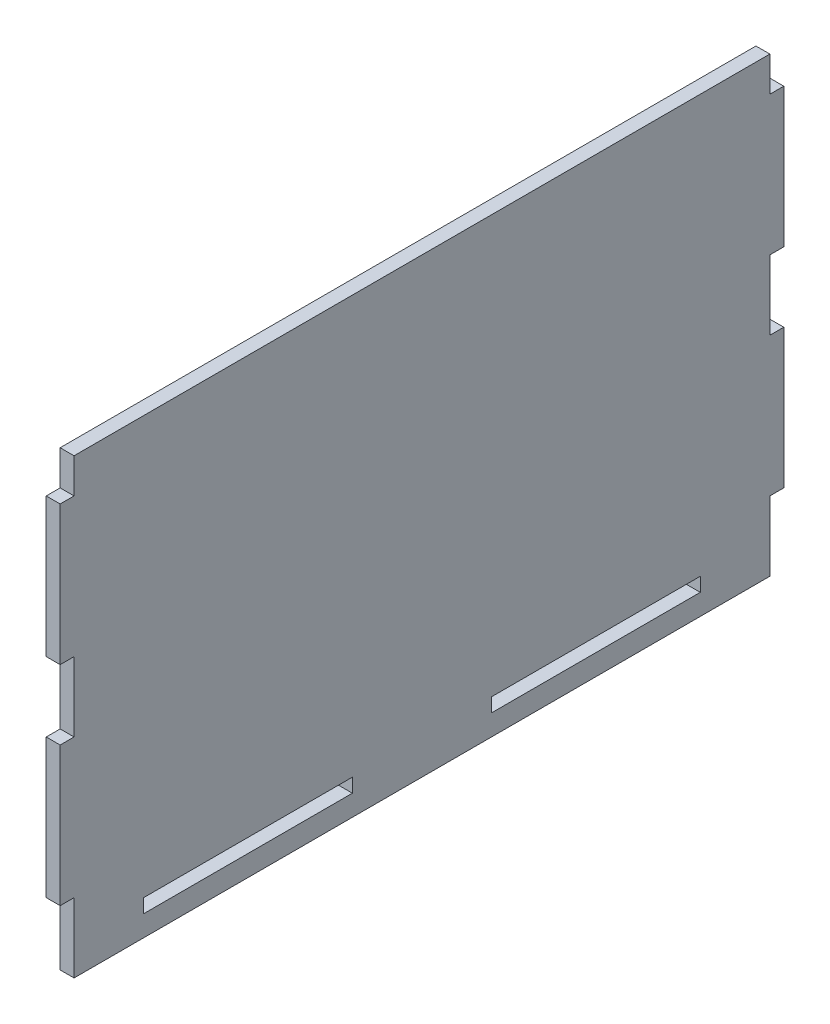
ISO-10303-21;
HEADER;
FILE_DESCRIPTION(('STEP AP214'),'2;1');
FILE_NAME('part.step','',(''),(''),'','','');
FILE_SCHEMA(('AUTOMOTIVE_DESIGN { 1 0 10303 214 1 1 1 1 }'));
ENDSEC;
DATA;
#1=APPLICATION_CONTEXT('core data for automotive mechanical design processes');
#2=APPLICATION_PROTOCOL_DEFINITION('international standard','automotive_design',2000,#1);
#3=PRODUCT_CONTEXT('',#1,'mechanical');
#4=PRODUCT('Part','Part','',(#3));
#5=PRODUCT_RELATED_PRODUCT_CATEGORY('part','',(#4));
#6=PRODUCT_DEFINITION_FORMATION('','',#4);
#7=PRODUCT_DEFINITION_CONTEXT('part definition',#1,'design');
#8=PRODUCT_DEFINITION('design','',#6,#7);
#9=PRODUCT_DEFINITION_SHAPE('','',#8);
#10=(LENGTH_UNIT() NAMED_UNIT(*) SI_UNIT(.MILLI.,.METRE.));
#11=(NAMED_UNIT(*) PLANE_ANGLE_UNIT() SI_UNIT($,.RADIAN.));
#12=(NAMED_UNIT(*) SI_UNIT($,.STERADIAN.) SOLID_ANGLE_UNIT());
#13=UNCERTAINTY_MEASURE_WITH_UNIT(LENGTH_MEASURE(1.E-05),#10,'distance_accuracy_value','');
#14=(GEOMETRIC_REPRESENTATION_CONTEXT(3) GLOBAL_UNCERTAINTY_ASSIGNED_CONTEXT((#13)) GLOBAL_UNIT_ASSIGNED_CONTEXT((#10,
#11,#12)) REPRESENTATION_CONTEXT('',''));
#15=CARTESIAN_POINT('',(0.,0.,0.));
#16=DIRECTION('',(0.,0.,1.));
#17=DIRECTION('',(1.,0.,0.));
#18=AXIS2_PLACEMENT_3D('',#15,#16,#17);
#19=CARTESIAN_POINT('',(20.,0.,0.));
#20=DIRECTION('',(1.,0.,0.));
#21=DIRECTION('',(0.,0.,-1.));
#22=AXIS2_PLACEMENT_3D('',#19,#20,#21);
#23=PLANE('',#22);
#24=DIRECTION('',(0.,-1.,0.));
#25=VECTOR('',#24,1.);
#26=CARTESIAN_POINT('',(20.,0.,0.));
#27=LINE('',#26,#25);
#28=CARTESIAN_POINT('',(20.,100.,2.67581096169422E-13));
#29=VERTEX_POINT('',#28);
#30=CARTESIAN_POINT('',(20.,0.,0.));
#31=VERTEX_POINT('',#30);
#32=EDGE_CURVE('E322',#29,#31,#27,.T.);
#33=ORIENTED_EDGE('',*,*,#32,.T.);
#34=DIRECTION('',(0.,0.,-1.));
#35=VECTOR('',#34,1.);
#36=CARTESIAN_POINT('',(20.,0.,0.));
#37=LINE('',#36,#35);
#38=CARTESIAN_POINT('',(20.,0.,-1000.));
#39=VERTEX_POINT('',#38);
#40=EDGE_CURVE('E326',#31,#39,#37,.T.);
#41=ORIENTED_EDGE('',*,*,#40,.T.);
#42=DIRECTION('',(0.,1.,0.));
#43=VECTOR('',#42,1.);
#44=CARTESIAN_POINT('',(20.,0.,-1000.));
#45=LINE('',#44,#43);
#46=CARTESIAN_POINT('',(20.,100.,-1000.));
#47=VERTEX_POINT('',#46);
#48=EDGE_CURVE('E330',#39,#47,#45,.T.);
#49=ORIENTED_EDGE('',*,*,#48,.T.);
#50=DIRECTION('',(0.,0.,-1.));
#51=VECTOR('',#50,1.);
#52=CARTESIAN_POINT('',(20.,100.,-1000.));
#53=LINE('',#52,#51);
#54=CARTESIAN_POINT('',(20.,100.,-1020.));
#55=VERTEX_POINT('',#54);
#56=EDGE_CURVE('E333',#47,#55,#53,.T.);
#57=ORIENTED_EDGE('',*,*,#56,.T.);
#58=DIRECTION('',(0.,1.,0.));
#59=VECTOR('',#58,1.);
#60=CARTESIAN_POINT('',(20.,300.,-1020.));
#61=LINE('',#60,#59);
#62=CARTESIAN_POINT('',(20.,300.,-1020.));
#63=VERTEX_POINT('',#62);
#64=EDGE_CURVE('E336',#55,#63,#61,.T.);
#65=ORIENTED_EDGE('',*,*,#64,.T.);
#66=DIRECTION('',(0.,0.,1.));
#67=VECTOR('',#66,1.);
#68=CARTESIAN_POINT('',(20.,300.,-1000.));
#69=LINE('',#68,#67);
#70=CARTESIAN_POINT('',(20.,300.,-1000.));
#71=VERTEX_POINT('',#70);
#72=EDGE_CURVE('E339',#63,#71,#69,.T.);
#73=ORIENTED_EDGE('',*,*,#72,.T.);
#74=DIRECTION('',(0.,1.,0.));
#75=VECTOR('',#74,1.);
#76=CARTESIAN_POINT('',(20.,300.,-1000.));
#77=LINE('',#76,#75);
#78=CARTESIAN_POINT('',(20.,400.,-1000.));
#79=VERTEX_POINT('',#78);
#80=EDGE_CURVE('E342',#71,#79,#77,.T.);
#81=ORIENTED_EDGE('',*,*,#80,.T.);
#82=DIRECTION('',(0.,0.,-1.));
#83=VECTOR('',#82,1.);
#84=CARTESIAN_POINT('',(20.,400.,-1000.));
#85=LINE('',#84,#83);
#86=CARTESIAN_POINT('',(20.,400.,-1020.));
#87=VERTEX_POINT('',#86);
#88=EDGE_CURVE('E345',#79,#87,#85,.T.);
#89=ORIENTED_EDGE('',*,*,#88,.T.);
#90=DIRECTION('',(0.,1.,0.));
#91=VECTOR('',#90,1.);
#92=CARTESIAN_POINT('',(20.,600.,-1020.));
#93=LINE('',#92,#91);
#94=CARTESIAN_POINT('',(20.,600.,-1020.));
#95=VERTEX_POINT('',#94);
#96=EDGE_CURVE('E348',#87,#95,#93,.T.);
#97=ORIENTED_EDGE('',*,*,#96,.T.);
#98=DIRECTION('',(0.,0.,1.));
#99=VECTOR('',#98,1.);
#100=CARTESIAN_POINT('',(20.,600.,-1000.));
#101=LINE('',#100,#99);
#102=CARTESIAN_POINT('',(20.,600.,-1000.));
#103=VERTEX_POINT('',#102);
#104=EDGE_CURVE('E351',#95,#103,#101,.T.);
#105=ORIENTED_EDGE('',*,*,#104,.T.);
#106=DIRECTION('',(0.,1.,0.));
#107=VECTOR('',#106,1.);
#108=CARTESIAN_POINT('',(20.,600.,-1000.));
#109=LINE('',#108,#107);
#110=CARTESIAN_POINT('',(20.,650.,-1000.));
#111=VERTEX_POINT('',#110);
#112=EDGE_CURVE('E354',#103,#111,#109,.T.);
#113=ORIENTED_EDGE('',*,*,#112,.T.);
#114=DIRECTION('',(0.,0.,1.));
#115=VECTOR('',#114,1.);
#116=CARTESIAN_POINT('',(20.,650.,0.));
#117=LINE('',#116,#115);
#118=CARTESIAN_POINT('',(20.,650.,0.));
#119=VERTEX_POINT('',#118);
#120=EDGE_CURVE('E357',#111,#119,#117,.T.);
#121=ORIENTED_EDGE('',*,*,#120,.T.);
#122=DIRECTION('',(0.,-1.,0.));
#123=VECTOR('',#122,1.);
#124=CARTESIAN_POINT('',(20.,600.,-3.29283909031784E-13));
#125=LINE('',#124,#123);
#126=CARTESIAN_POINT('',(20.,600.,-3.29283909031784E-13));
#127=VERTEX_POINT('',#126);
#128=EDGE_CURVE('E360',#119,#127,#125,.T.);
#129=ORIENTED_EDGE('',*,*,#128,.T.);
#130=DIRECTION('',(0.,0.,1.));
#131=VECTOR('',#130,1.);
#132=CARTESIAN_POINT('',(20.,600.,-3.29283909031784E-13));
#133=LINE('',#132,#131);
#134=CARTESIAN_POINT('',(20.,600.,19.9999999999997));
#135=VERTEX_POINT('',#134);
#136=EDGE_CURVE('E363',#127,#135,#133,.T.);
#137=ORIENTED_EDGE('',*,*,#136,.T.);
#138=DIRECTION('',(0.,-1.,0.));
#139=VECTOR('',#138,1.);
#140=CARTESIAN_POINT('',(20.,600.,19.9999999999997));
#141=LINE('',#140,#139);
#142=CARTESIAN_POINT('',(20.,400.,19.9999999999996));
#143=VERTEX_POINT('',#142);
#144=EDGE_CURVE('E366',#135,#143,#141,.T.);
#145=ORIENTED_EDGE('',*,*,#144,.T.);
#146=DIRECTION('',(0.,0.,-1.));
#147=VECTOR('',#146,1.);
#148=CARTESIAN_POINT('',(20.,400.,-2.15105711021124E-13));
#149=LINE('',#148,#147);
#150=CARTESIAN_POINT('',(20.,400.,-2.15105711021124E-13));
#151=VERTEX_POINT('',#150);
#152=EDGE_CURVE('E369',#143,#151,#149,.T.);
#153=ORIENTED_EDGE('',*,*,#152,.T.);
#154=DIRECTION('',(0.,-1.,0.));
#155=VECTOR('',#154,1.);
#156=CARTESIAN_POINT('',(20.,300.,-1.6306400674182E-13));
#157=LINE('',#156,#155);
#158=CARTESIAN_POINT('',(20.,300.,-1.6306400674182E-13));
#159=VERTEX_POINT('',#158);
#160=EDGE_CURVE('E372',#151,#159,#157,.T.);
#161=ORIENTED_EDGE('',*,*,#160,.T.);
#162=DIRECTION('',(0.,0.,1.));
#163=VECTOR('',#162,1.);
#164=CARTESIAN_POINT('',(20.,300.,-1.6306400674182E-13));
#165=LINE('',#164,#163);
#166=CARTESIAN_POINT('',(20.,300.,19.9999999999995));
#167=VERTEX_POINT('',#166);
#168=EDGE_CURVE('E375',#159,#167,#165,.T.);
#169=ORIENTED_EDGE('',*,*,#168,.T.);
#170=DIRECTION('',(0.,-1.,0.));
#171=VECTOR('',#170,1.);
#172=CARTESIAN_POINT('',(20.,300.,19.9999999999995));
#173=LINE('',#172,#171);
#174=CARTESIAN_POINT('',(20.,100.,19.9999999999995));
#175=VERTEX_POINT('',#174);
#176=EDGE_CURVE('E378',#167,#175,#173,.T.);
#177=ORIENTED_EDGE('',*,*,#176,.T.);
#178=DIRECTION('',(0.,0.,-1.));
#179=VECTOR('',#178,1.);
#180=CARTESIAN_POINT('',(20.,100.,2.67581096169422E-13));
#181=LINE('',#180,#179);
#182=EDGE_CURVE('E381',#175,#29,#181,.T.);
#183=ORIENTED_EDGE('',*,*,#182,.T.);
#184=EDGE_LOOP('',(#33,#41,#49,#57,#65,#73,#81,#89,#97,#105,#113,#121,#129,#137,#145,#153,#161,
#169,#177,#183));
#185=FACE_BOUND('',#184,.T.);
#186=DIRECTION('',(0.,0.,-1.));
#187=VECTOR('',#186,1.);
#188=CARTESIAN_POINT('',(20.,30.0000000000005,-100.));
#189=LINE('',#188,#187);
#190=CARTESIAN_POINT('',(20.,30.0000000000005,-100.));
#191=VERTEX_POINT('',#190);
#192=CARTESIAN_POINT('',(20.,30.0000000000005,-400.));
#193=VERTEX_POINT('',#192);
#194=EDGE_CURVE('E282',#191,#193,#189,.T.);
#195=ORIENTED_EDGE('',*,*,#194,.F.);
#196=DIRECTION('',(0.,-1.,0.));
#197=VECTOR('',#196,1.);
#198=CARTESIAN_POINT('',(20.,50.,-100.));
#199=LINE('',#198,#197);
#200=CARTESIAN_POINT('',(20.,50.,-100.));
#201=VERTEX_POINT('',#200);
#202=EDGE_CURVE('E279',#201,#191,#199,.T.);
#203=ORIENTED_EDGE('',*,*,#202,.F.);
#204=DIRECTION('',(0.,0.,1.));
#205=VECTOR('',#204,1.);
#206=CARTESIAN_POINT('',(20.,50.,-100.));
#207=LINE('',#206,#205);
#208=CARTESIAN_POINT('',(20.,50.,-400.));
#209=VERTEX_POINT('',#208);
#210=EDGE_CURVE('E290',#209,#201,#207,.T.);
#211=ORIENTED_EDGE('',*,*,#210,.F.);
#212=DIRECTION('',(0.,1.,0.));
#213=VECTOR('',#212,1.);
#214=CARTESIAN_POINT('',(20.,50.,-400.));
#215=LINE('',#214,#213);
#216=EDGE_CURVE('E286',#193,#209,#215,.T.);
#217=ORIENTED_EDGE('',*,*,#216,.F.);
#218=EDGE_LOOP('',(#195,#203,#211,#217));
#219=FACE_BOUND('',#218,.T.);
#220=DIRECTION('',(0.,0.,-1.));
#221=VECTOR('',#220,1.);
#222=CARTESIAN_POINT('',(20.,30.0000000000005,-600.));
#223=LINE('',#222,#221);
#224=CARTESIAN_POINT('',(20.,30.0000000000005,-600.));
#225=VERTEX_POINT('',#224);
#226=CARTESIAN_POINT('',(20.,30.0000000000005,-900.));
#227=VERTEX_POINT('',#226);
#228=EDGE_CURVE('E240',#225,#227,#223,.T.);
#229=ORIENTED_EDGE('',*,*,#228,.F.);
#230=DIRECTION('',(0.,-1.,0.));
#231=VECTOR('',#230,1.);
#232=CARTESIAN_POINT('',(20.,50.,-600.));
#233=LINE('',#232,#231);
#234=CARTESIAN_POINT('',(20.,50.,-600.));
#235=VERTEX_POINT('',#234);
#236=EDGE_CURVE('E231',#235,#225,#233,.T.);
#237=ORIENTED_EDGE('',*,*,#236,.F.);
#238=DIRECTION('',(0.,0.,1.));
#239=VECTOR('',#238,1.);
#240=CARTESIAN_POINT('',(20.,50.,-600.));
#241=LINE('',#240,#239);
#242=CARTESIAN_POINT('',(20.,50.,-900.));
#243=VERTEX_POINT('',#242);
#244=EDGE_CURVE('E257',#243,#235,#241,.T.);
#245=ORIENTED_EDGE('',*,*,#244,.F.);
#246=DIRECTION('',(0.,1.,0.));
#247=VECTOR('',#246,1.);
#248=CARTESIAN_POINT('',(20.,50.,-900.));
#249=LINE('',#248,#247);
#250=EDGE_CURVE('E253',#227,#243,#249,.T.);
#251=ORIENTED_EDGE('',*,*,#250,.F.);
#252=EDGE_LOOP('',(#229,#237,#245,#251));
#253=FACE_BOUND('',#252,.T.);
#254=ADVANCED_FACE('F45',(#185,#219,#253),#23,.T.);
#255=CARTESIAN_POINT('',(0.,0.,0.));
#256=DIRECTION('',(1.,0.,0.));
#257=DIRECTION('',(0.,0.,-1.));
#258=AXIS2_PLACEMENT_3D('',#255,#256,#257);
#259=PLANE('',#258);
#260=DIRECTION('',(0.,-1.,0.));
#261=VECTOR('',#260,1.);
#262=CARTESIAN_POINT('',(0.,50.,-100.));
#263=LINE('',#262,#261);
#264=CARTESIAN_POINT('',(0.,50.,-100.));
#265=VERTEX_POINT('',#264);
#266=CARTESIAN_POINT('',(0.,30.0000000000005,-100.));
#267=VERTEX_POINT('',#266);
#268=EDGE_CURVE('E249',#265,#267,#263,.T.);
#269=ORIENTED_EDGE('',*,*,#268,.T.);
#270=DIRECTION('',(0.,0.,-1.));
#271=VECTOR('',#270,1.);
#272=CARTESIAN_POINT('',(0.,30.0000000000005,-100.));
#273=LINE('',#272,#271);
#274=CARTESIAN_POINT('',(0.,30.0000000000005,-400.));
#275=VERTEX_POINT('',#274);
#276=EDGE_CURVE('E297',#267,#275,#273,.T.);
#277=ORIENTED_EDGE('',*,*,#276,.T.);
#278=DIRECTION('',(0.,1.,0.));
#279=VECTOR('',#278,1.);
#280=CARTESIAN_POINT('',(0.,50.,-400.));
#281=LINE('',#280,#279);
#282=CARTESIAN_POINT('',(0.,50.,-400.));
#283=VERTEX_POINT('',#282);
#284=EDGE_CURVE('E301',#275,#283,#281,.T.);
#285=ORIENTED_EDGE('',*,*,#284,.T.);
#286=DIRECTION('',(0.,0.,1.));
#287=VECTOR('',#286,1.);
#288=CARTESIAN_POINT('',(0.,50.,-100.));
#289=LINE('',#288,#287);
#290=EDGE_CURVE('E283',#283,#265,#289,.T.);
#291=ORIENTED_EDGE('',*,*,#290,.T.);
#292=EDGE_LOOP('',(#269,#277,#285,#291));
#293=FACE_BOUND('',#292,.T.);
#294=DIRECTION('',(0.,-1.,0.));
#295=VECTOR('',#294,1.);
#296=CARTESIAN_POINT('',(0.,0.,0.));
#297=LINE('',#296,#295);
#298=CARTESIAN_POINT('',(0.,100.,2.67581096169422E-13));
#299=VERTEX_POINT('',#298);
#300=CARTESIAN_POINT('',(0.,0.,0.));
#301=VERTEX_POINT('',#300);
#302=EDGE_CURVE('E321',#299,#301,#297,.T.);
#303=ORIENTED_EDGE('',*,*,#302,.F.);
#304=DIRECTION('',(0.,0.,-1.));
#305=VECTOR('',#304,1.);
#306=CARTESIAN_POINT('',(0.,100.,2.67581096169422E-13));
#307=LINE('',#306,#305);
#308=CARTESIAN_POINT('',(0.,100.,19.9999999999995));
#309=VERTEX_POINT('',#308);
#310=EDGE_CURVE('E327',#309,#299,#307,.T.);
#311=ORIENTED_EDGE('',*,*,#310,.F.);
#312=DIRECTION('',(0.,-1.,0.));
#313=VECTOR('',#312,1.);
#314=CARTESIAN_POINT('',(0.,300.,19.9999999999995));
#315=LINE('',#314,#313);
#316=CARTESIAN_POINT('',(0.,300.,19.9999999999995));
#317=VERTEX_POINT('',#316);
#318=EDGE_CURVE('E439',#317,#309,#315,.T.);
#319=ORIENTED_EDGE('',*,*,#318,.F.);
#320=DIRECTION('',(0.,0.,1.));
#321=VECTOR('',#320,1.);
#322=CARTESIAN_POINT('',(0.,300.,-1.6306400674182E-13));
#323=LINE('',#322,#321);
#324=CARTESIAN_POINT('',(0.,300.,-1.6306400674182E-13));
#325=VERTEX_POINT('',#324);
#326=EDGE_CURVE('E436',#325,#317,#323,.T.);
#327=ORIENTED_EDGE('',*,*,#326,.F.);
#328=DIRECTION('',(0.,-1.,0.));
#329=VECTOR('',#328,1.);
#330=CARTESIAN_POINT('',(0.,300.,-1.6306400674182E-13));
#331=LINE('',#330,#329);
#332=CARTESIAN_POINT('',(0.,400.,-2.15105711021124E-13));
#333=VERTEX_POINT('',#332);
#334=EDGE_CURVE('E433',#333,#325,#331,.T.);
#335=ORIENTED_EDGE('',*,*,#334,.F.);
#336=DIRECTION('',(0.,0.,-1.));
#337=VECTOR('',#336,1.);
#338=CARTESIAN_POINT('',(0.,400.,-2.15105711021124E-13));
#339=LINE('',#338,#337);
#340=CARTESIAN_POINT('',(0.,400.,19.9999999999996));
#341=VERTEX_POINT('',#340);
#342=EDGE_CURVE('E430',#341,#333,#339,.T.);
#343=ORIENTED_EDGE('',*,*,#342,.F.);
#344=DIRECTION('',(0.,-1.,0.));
#345=VECTOR('',#344,1.);
#346=CARTESIAN_POINT('',(0.,600.,19.9999999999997));
#347=LINE('',#346,#345);
#348=CARTESIAN_POINT('',(0.,600.,19.9999999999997));
#349=VERTEX_POINT('',#348);
#350=EDGE_CURVE('E427',#349,#341,#347,.T.);
#351=ORIENTED_EDGE('',*,*,#350,.F.);
#352=DIRECTION('',(0.,0.,1.));
#353=VECTOR('',#352,1.);
#354=CARTESIAN_POINT('',(0.,600.,-3.29283909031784E-13));
#355=LINE('',#354,#353);
#356=CARTESIAN_POINT('',(0.,600.,-3.29283909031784E-13));
#357=VERTEX_POINT('',#356);
#358=EDGE_CURVE('E424',#357,#349,#355,.T.);
#359=ORIENTED_EDGE('',*,*,#358,.F.);
#360=DIRECTION('',(0.,-1.,0.));
#361=VECTOR('',#360,1.);
#362=CARTESIAN_POINT('',(0.,600.,-3.29283909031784E-13));
#363=LINE('',#362,#361);
#364=CARTESIAN_POINT('',(0.,650.,0.));
#365=VERTEX_POINT('',#364);
#366=EDGE_CURVE('E421',#365,#357,#363,.T.);
#367=ORIENTED_EDGE('',*,*,#366,.F.);
#368=DIRECTION('',(0.,0.,1.));
#369=VECTOR('',#368,1.);
#370=CARTESIAN_POINT('',(0.,650.,0.));
#371=LINE('',#370,#369);
#372=CARTESIAN_POINT('',(0.,650.,-1000.));
#373=VERTEX_POINT('',#372);
#374=EDGE_CURVE('E418',#373,#365,#371,.T.);
#375=ORIENTED_EDGE('',*,*,#374,.F.);
#376=DIRECTION('',(0.,1.,0.));
#377=VECTOR('',#376,1.);
#378=CARTESIAN_POINT('',(0.,600.,-1000.));
#379=LINE('',#378,#377);
#380=CARTESIAN_POINT('',(0.,600.,-1000.));
#381=VERTEX_POINT('',#380);
#382=EDGE_CURVE('E415',#381,#373,#379,.T.);
#383=ORIENTED_EDGE('',*,*,#382,.F.);
#384=DIRECTION('',(0.,0.,1.));
#385=VECTOR('',#384,1.);
#386=CARTESIAN_POINT('',(0.,600.,-1000.));
#387=LINE('',#386,#385);
#388=CARTESIAN_POINT('',(0.,600.,-1020.));
#389=VERTEX_POINT('',#388);
#390=EDGE_CURVE('E412',#389,#381,#387,.T.);
#391=ORIENTED_EDGE('',*,*,#390,.F.);
#392=DIRECTION('',(0.,1.,0.));
#393=VECTOR('',#392,1.);
#394=CARTESIAN_POINT('',(0.,600.,-1020.));
#395=LINE('',#394,#393);
#396=CARTESIAN_POINT('',(0.,400.,-1020.));
#397=VERTEX_POINT('',#396);
#398=EDGE_CURVE('E409',#397,#389,#395,.T.);
#399=ORIENTED_EDGE('',*,*,#398,.F.);
#400=DIRECTION('',(0.,0.,-1.));
#401=VECTOR('',#400,1.);
#402=CARTESIAN_POINT('',(0.,400.,-1000.));
#403=LINE('',#402,#401);
#404=CARTESIAN_POINT('',(0.,400.,-1000.));
#405=VERTEX_POINT('',#404);
#406=EDGE_CURVE('E406',#405,#397,#403,.T.);
#407=ORIENTED_EDGE('',*,*,#406,.F.);
#408=DIRECTION('',(0.,1.,0.));
#409=VECTOR('',#408,1.);
#410=CARTESIAN_POINT('',(0.,300.,-1000.));
#411=LINE('',#410,#409);
#412=CARTESIAN_POINT('',(0.,300.,-1000.));
#413=VERTEX_POINT('',#412);
#414=EDGE_CURVE('E403',#413,#405,#411,.T.);
#415=ORIENTED_EDGE('',*,*,#414,.F.);
#416=DIRECTION('',(0.,0.,1.));
#417=VECTOR('',#416,1.);
#418=CARTESIAN_POINT('',(0.,300.,-1000.));
#419=LINE('',#418,#417);
#420=CARTESIAN_POINT('',(0.,300.,-1020.));
#421=VERTEX_POINT('',#420);
#422=EDGE_CURVE('E400',#421,#413,#419,.T.);
#423=ORIENTED_EDGE('',*,*,#422,.F.);
#424=DIRECTION('',(0.,1.,0.));
#425=VECTOR('',#424,1.);
#426=CARTESIAN_POINT('',(0.,300.,-1020.));
#427=LINE('',#426,#425);
#428=CARTESIAN_POINT('',(0.,100.,-1020.));
#429=VERTEX_POINT('',#428);
#430=EDGE_CURVE('E397',#429,#421,#427,.T.);
#431=ORIENTED_EDGE('',*,*,#430,.F.);
#432=DIRECTION('',(0.,0.,-1.));
#433=VECTOR('',#432,1.);
#434=CARTESIAN_POINT('',(0.,100.,-1000.));
#435=LINE('',#434,#433);
#436=CARTESIAN_POINT('',(0.,100.,-1000.));
#437=VERTEX_POINT('',#436);
#438=EDGE_CURVE('E394',#437,#429,#435,.T.);
#439=ORIENTED_EDGE('',*,*,#438,.F.);
#440=DIRECTION('',(0.,1.,0.));
#441=VECTOR('',#440,1.);
#442=CARTESIAN_POINT('',(0.,0.,-1000.));
#443=LINE('',#442,#441);
#444=CARTESIAN_POINT('',(0.,0.,-1000.));
#445=VERTEX_POINT('',#444);
#446=EDGE_CURVE('E391',#445,#437,#443,.T.);
#447=ORIENTED_EDGE('',*,*,#446,.F.);
#448=DIRECTION('',(0.,0.,-1.));
#449=VECTOR('',#448,1.);
#450=CARTESIAN_POINT('',(0.,0.,0.));
#451=LINE('',#450,#449);
#452=EDGE_CURVE('E388',#301,#445,#451,.T.);
#453=ORIENTED_EDGE('',*,*,#452,.F.);
#454=EDGE_LOOP('',(#303,#311,#319,#327,#335,#343,#351,#359,#367,#375,#383,#391,#399,#407,#415,
#423,#431,#439,#447,#453));
#455=FACE_BOUND('',#454,.T.);
#456=DIRECTION('',(0.,-1.,0.));
#457=VECTOR('',#456,1.);
#458=CARTESIAN_POINT('',(0.,50.,-600.));
#459=LINE('',#458,#457);
#460=CARTESIAN_POINT('',(0.,50.,-600.));
#461=VERTEX_POINT('',#460);
#462=CARTESIAN_POINT('',(0.,30.0000000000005,-600.));
#463=VERTEX_POINT('',#462);
#464=EDGE_CURVE('E69',#461,#463,#459,.T.);
#465=ORIENTED_EDGE('',*,*,#464,.T.);
#466=DIRECTION('',(0.,0.,-1.));
#467=VECTOR('',#466,1.);
#468=CARTESIAN_POINT('',(0.,30.0000000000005,-600.));
#469=LINE('',#468,#467);
#470=CARTESIAN_POINT('',(0.,30.0000000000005,-900.));
#471=VERTEX_POINT('',#470);
#472=EDGE_CURVE('E247',#463,#471,#469,.T.);
#473=ORIENTED_EDGE('',*,*,#472,.T.);
#474=DIRECTION('',(0.,1.,0.));
#475=VECTOR('',#474,1.);
#476=CARTESIAN_POINT('',(0.,50.,-900.));
#477=LINE('',#476,#475);
#478=CARTESIAN_POINT('',(0.,50.,-900.));
#479=VERTEX_POINT('',#478);
#480=EDGE_CURVE('E266',#471,#479,#477,.T.);
#481=ORIENTED_EDGE('',*,*,#480,.T.);
#482=DIRECTION('',(0.,0.,1.));
#483=VECTOR('',#482,1.);
#484=CARTESIAN_POINT('',(0.,50.,-600.));
#485=LINE('',#484,#483);
#486=EDGE_CURVE('E241',#479,#461,#485,.T.);
#487=ORIENTED_EDGE('',*,*,#486,.T.);
#488=EDGE_LOOP('',(#465,#473,#481,#487));
#489=FACE_BOUND('',#488,.T.);
#490=ADVANCED_FACE('F526',(#293,#455,#489),#259,.F.);
#491=CARTESIAN_POINT('',(20.,0.,0.));
#492=DIRECTION('',(0.,0.,-1.));
#493=DIRECTION('',(0.,1.,0.));
#494=AXIS2_PLACEMENT_3D('',#491,#492,#493);
#495=PLANE('',#494);
#496=ORIENTED_EDGE('',*,*,#302,.T.);
#497=DIRECTION('',(-1.,0.,0.));
#498=VECTOR('',#497,1.);
#499=CARTESIAN_POINT('',(20.,0.,0.));
#500=LINE('',#499,#498);
#501=EDGE_CURVE('E11',#31,#301,#500,.T.);
#502=ORIENTED_EDGE('',*,*,#501,.F.);
#503=ORIENTED_EDGE('',*,*,#32,.F.);
#504=DIRECTION('',(-1.,0.,0.));
#505=VECTOR('',#504,1.);
#506=CARTESIAN_POINT('',(20.,100.,2.67581096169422E-13));
#507=LINE('',#506,#505);
#508=EDGE_CURVE('E384',#29,#299,#507,.T.);
#509=ORIENTED_EDGE('',*,*,#508,.T.);
#510=EDGE_LOOP('',(#496,#502,#503,#509));
#511=FACE_BOUND('',#510,.T.);
#512=ADVANCED_FACE('F47',(#511),#495,.F.);
#513=CARTESIAN_POINT('',(20.,0.,0.));
#514=DIRECTION('',(0.,1.,0.));
#515=DIRECTION('',(0.,0.,1.));
#516=AXIS2_PLACEMENT_3D('',#513,#514,#515);
#517=PLANE('',#516);
#518=ORIENTED_EDGE('',*,*,#452,.T.);
#519=DIRECTION('',(-1.,0.,0.));
#520=VECTOR('',#519,1.);
#521=CARTESIAN_POINT('',(20.,0.,-1000.));
#522=LINE('',#521,#520);
#523=EDGE_CURVE('E54',#39,#445,#522,.T.);
#524=ORIENTED_EDGE('',*,*,#523,.F.);
#525=ORIENTED_EDGE('',*,*,#40,.F.);
#526=ORIENTED_EDGE('',*,*,#501,.T.);
#527=EDGE_LOOP('',(#518,#524,#525,#526));
#528=FACE_BOUND('',#527,.T.);
#529=ADVANCED_FACE('F544',(#528),#517,.F.);
#530=CARTESIAN_POINT('',(20.,0.,-1000.));
#531=DIRECTION('',(0.,0.,1.));
#532=DIRECTION('',(0.,-1.,0.));
#533=AXIS2_PLACEMENT_3D('',#530,#531,#532);
#534=PLANE('',#533);
#535=ORIENTED_EDGE('',*,*,#446,.T.);
#536=DIRECTION('',(-1.,0.,0.));
#537=VECTOR('',#536,1.);
#538=CARTESIAN_POINT('',(20.,100.,-1000.));
#539=LINE('',#538,#537);
#540=EDGE_CURVE('E511',#47,#437,#539,.T.);
#541=ORIENTED_EDGE('',*,*,#540,.F.);
#542=ORIENTED_EDGE('',*,*,#48,.F.);
#543=ORIENTED_EDGE('',*,*,#523,.T.);
#544=EDGE_LOOP('',(#535,#541,#542,#543));
#545=FACE_BOUND('',#544,.T.);
#546=ADVANCED_FACE('F520',(#545),#534,.F.);
#547=CARTESIAN_POINT('',(20.,100.,-1000.));
#548=DIRECTION('',(0.,1.,0.));
#549=DIRECTION('',(0.,0.,1.));
#550=AXIS2_PLACEMENT_3D('',#547,#548,#549);
#551=PLANE('',#550);
#552=ORIENTED_EDGE('',*,*,#438,.T.);
#553=DIRECTION('',(-1.,0.,0.));
#554=VECTOR('',#553,1.);
#555=CARTESIAN_POINT('',(20.,100.,-1020.));
#556=LINE('',#555,#554);
#557=EDGE_CURVE('E507',#55,#429,#556,.T.);
#558=ORIENTED_EDGE('',*,*,#557,.F.);
#559=ORIENTED_EDGE('',*,*,#56,.F.);
#560=ORIENTED_EDGE('',*,*,#540,.T.);
#561=EDGE_LOOP('',(#552,#558,#559,#560));
#562=FACE_BOUND('',#561,.T.);
#563=ADVANCED_FACE('F532',(#562),#551,.F.);
#564=CARTESIAN_POINT('',(20.,300.,-1020.));
#565=DIRECTION('',(0.,0.,1.));
#566=DIRECTION('',(1.,0.,0.));
#567=AXIS2_PLACEMENT_3D('',#564,#565,#566);
#568=PLANE('',#567);
#569=ORIENTED_EDGE('',*,*,#430,.T.);
#570=DIRECTION('',(-1.,0.,0.));
#571=VECTOR('',#570,1.);
#572=CARTESIAN_POINT('',(20.,300.,-1020.));
#573=LINE('',#572,#571);
#574=EDGE_CURVE('E503',#63,#421,#573,.T.);
#575=ORIENTED_EDGE('',*,*,#574,.F.);
#576=ORIENTED_EDGE('',*,*,#64,.F.);
#577=ORIENTED_EDGE('',*,*,#557,.T.);
#578=EDGE_LOOP('',(#569,#575,#576,#577));
#579=FACE_BOUND('',#578,.T.);
#580=ADVANCED_FACE('F536',(#579),#568,.F.);
#581=CARTESIAN_POINT('',(20.,300.,-1000.));
#582=DIRECTION('',(0.,-1.,0.));
#583=DIRECTION('',(0.,0.,-1.));
#584=AXIS2_PLACEMENT_3D('',#581,#582,#583);
#585=PLANE('',#584);
#586=ORIENTED_EDGE('',*,*,#422,.T.);
#587=DIRECTION('',(-1.,0.,0.));
#588=VECTOR('',#587,1.);
#589=CARTESIAN_POINT('',(20.,300.,-1000.));
#590=LINE('',#589,#588);
#591=EDGE_CURVE('E499',#71,#413,#590,.T.);
#592=ORIENTED_EDGE('',*,*,#591,.F.);
#593=ORIENTED_EDGE('',*,*,#72,.F.);
#594=ORIENTED_EDGE('',*,*,#574,.T.);
#595=EDGE_LOOP('',(#586,#592,#593,#594));
#596=FACE_BOUND('',#595,.T.);
#597=ADVANCED_FACE('F617',(#596),#585,.F.);
#598=CARTESIAN_POINT('',(20.,300.,-1000.));
#599=DIRECTION('',(0.,0.,1.));
#600=DIRECTION('',(1.,0.,0.));
#601=AXIS2_PLACEMENT_3D('',#598,#599,#600);
#602=PLANE('',#601);
#603=ORIENTED_EDGE('',*,*,#414,.T.);
#604=DIRECTION('',(-1.,0.,0.));
#605=VECTOR('',#604,1.);
#606=CARTESIAN_POINT('',(20.,400.,-1000.));
#607=LINE('',#606,#605);
#608=EDGE_CURVE('E495',#79,#405,#607,.T.);
#609=ORIENTED_EDGE('',*,*,#608,.F.);
#610=ORIENTED_EDGE('',*,*,#80,.F.);
#611=ORIENTED_EDGE('',*,*,#591,.T.);
#612=EDGE_LOOP('',(#603,#609,#610,#611));
#613=FACE_BOUND('',#612,.T.);
#614=ADVANCED_FACE('F615',(#613),#602,.F.);
#615=CARTESIAN_POINT('',(20.,400.,-1000.));
#616=DIRECTION('',(0.,1.,0.));
#617=DIRECTION('',(0.,0.,1.));
#618=AXIS2_PLACEMENT_3D('',#615,#616,#617);
#619=PLANE('',#618);
#620=ORIENTED_EDGE('',*,*,#406,.T.);
#621=DIRECTION('',(-1.,0.,0.));
#622=VECTOR('',#621,1.);
#623=CARTESIAN_POINT('',(20.,400.,-1020.));
#624=LINE('',#623,#622);
#625=EDGE_CURVE('E491',#87,#397,#624,.T.);
#626=ORIENTED_EDGE('',*,*,#625,.F.);
#627=ORIENTED_EDGE('',*,*,#88,.F.);
#628=ORIENTED_EDGE('',*,*,#608,.T.);
#629=EDGE_LOOP('',(#620,#626,#627,#628));
#630=FACE_BOUND('',#629,.T.);
#631=ADVANCED_FACE('F610',(#630),#619,.F.);
#632=CARTESIAN_POINT('',(20.,600.,-1020.));
#633=DIRECTION('',(0.,0.,1.));
#634=DIRECTION('',(0.,-1.,0.));
#635=AXIS2_PLACEMENT_3D('',#632,#633,#634);
#636=PLANE('',#635);
#637=ORIENTED_EDGE('',*,*,#398,.T.);
#638=DIRECTION('',(-1.,0.,0.));
#639=VECTOR('',#638,1.);
#640=CARTESIAN_POINT('',(20.,600.,-1020.));
#641=LINE('',#640,#639);
#642=EDGE_CURVE('E487',#95,#389,#641,.T.);
#643=ORIENTED_EDGE('',*,*,#642,.F.);
#644=ORIENTED_EDGE('',*,*,#96,.F.);
#645=ORIENTED_EDGE('',*,*,#625,.T.);
#646=EDGE_LOOP('',(#637,#643,#644,#645));
#647=FACE_BOUND('',#646,.T.);
#648=ADVANCED_FACE('F605',(#647),#636,.F.);
#649=CARTESIAN_POINT('',(20.,600.,-1000.));
#650=DIRECTION('',(0.,-1.,0.));
#651=DIRECTION('',(0.,0.,-1.));
#652=AXIS2_PLACEMENT_3D('',#649,#650,#651);
#653=PLANE('',#652);
#654=ORIENTED_EDGE('',*,*,#390,.T.);
#655=DIRECTION('',(-1.,0.,0.));
#656=VECTOR('',#655,1.);
#657=CARTESIAN_POINT('',(20.,600.,-1000.));
#658=LINE('',#657,#656);
#659=EDGE_CURVE('E483',#103,#381,#658,.T.);
#660=ORIENTED_EDGE('',*,*,#659,.F.);
#661=ORIENTED_EDGE('',*,*,#104,.F.);
#662=ORIENTED_EDGE('',*,*,#642,.T.);
#663=EDGE_LOOP('',(#654,#660,#661,#662));
#664=FACE_BOUND('',#663,.T.);
#665=ADVANCED_FACE('F601',(#664),#653,.F.);
#666=CARTESIAN_POINT('',(20.,600.,-1000.));
#667=DIRECTION('',(0.,0.,1.));
#668=DIRECTION('',(0.,-1.,0.));
#669=AXIS2_PLACEMENT_3D('',#666,#667,#668);
#670=PLANE('',#669);
#671=ORIENTED_EDGE('',*,*,#382,.T.);
#672=DIRECTION('',(-1.,0.,0.));
#673=VECTOR('',#672,1.);
#674=CARTESIAN_POINT('',(20.,650.,-1000.));
#675=LINE('',#674,#673);
#676=EDGE_CURVE('E479',#111,#373,#675,.T.);
#677=ORIENTED_EDGE('',*,*,#676,.F.);
#678=ORIENTED_EDGE('',*,*,#112,.F.);
#679=ORIENTED_EDGE('',*,*,#659,.T.);
#680=EDGE_LOOP('',(#671,#677,#678,#679));
#681=FACE_BOUND('',#680,.T.);
#682=ADVANCED_FACE('F596',(#681),#670,.F.);
#683=CARTESIAN_POINT('',(20.,650.,0.));
#684=DIRECTION('',(0.,-1.,0.));
#685=DIRECTION('',(0.,0.,-1.));
#686=AXIS2_PLACEMENT_3D('',#683,#684,#685);
#687=PLANE('',#686);
#688=ORIENTED_EDGE('',*,*,#374,.T.);
#689=DIRECTION('',(-1.,0.,0.));
#690=VECTOR('',#689,1.);
#691=CARTESIAN_POINT('',(20.,650.,0.));
#692=LINE('',#691,#690);
#693=EDGE_CURVE('E475',#119,#365,#692,.T.);
#694=ORIENTED_EDGE('',*,*,#693,.F.);
#695=ORIENTED_EDGE('',*,*,#120,.F.);
#696=ORIENTED_EDGE('',*,*,#676,.T.);
#697=EDGE_LOOP('',(#688,#694,#695,#696));
#698=FACE_BOUND('',#697,.T.);
#699=ADVANCED_FACE('F590',(#698),#687,.F.);
#700=CARTESIAN_POINT('',(20.,600.,-3.29283909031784E-13));
#701=DIRECTION('',(0.,0.,-1.));
#702=DIRECTION('',(0.,1.,0.));
#703=AXIS2_PLACEMENT_3D('',#700,#701,#702);
#704=PLANE('',#703);
#705=ORIENTED_EDGE('',*,*,#366,.T.);
#706=DIRECTION('',(-1.,0.,0.));
#707=VECTOR('',#706,1.);
#708=CARTESIAN_POINT('',(20.,600.,-3.29283909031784E-13));
#709=LINE('',#708,#707);
#710=EDGE_CURVE('E471',#127,#357,#709,.T.);
#711=ORIENTED_EDGE('',*,*,#710,.F.);
#712=ORIENTED_EDGE('',*,*,#128,.F.);
#713=ORIENTED_EDGE('',*,*,#693,.T.);
#714=EDGE_LOOP('',(#705,#711,#712,#713));
#715=FACE_BOUND('',#714,.T.);
#716=ADVANCED_FACE('F586',(#715),#704,.F.);
#717=CARTESIAN_POINT('',(20.,600.,-3.29283909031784E-13));
#718=DIRECTION('',(0.,-1.,0.));
#719=DIRECTION('',(0.,0.,-1.));
#720=AXIS2_PLACEMENT_3D('',#717,#718,#719);
#721=PLANE('',#720);
#722=ORIENTED_EDGE('',*,*,#358,.T.);
#723=DIRECTION('',(-1.,0.,0.));
#724=VECTOR('',#723,1.);
#725=CARTESIAN_POINT('',(20.,600.,19.9999999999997));
#726=LINE('',#725,#724);
#727=EDGE_CURVE('E467',#135,#349,#726,.T.);
#728=ORIENTED_EDGE('',*,*,#727,.F.);
#729=ORIENTED_EDGE('',*,*,#136,.F.);
#730=ORIENTED_EDGE('',*,*,#710,.T.);
#731=EDGE_LOOP('',(#722,#728,#729,#730));
#732=FACE_BOUND('',#731,.T.);
#733=ADVANCED_FACE('F581',(#732),#721,.F.);
#734=CARTESIAN_POINT('',(20.,600.,19.9999999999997));
#735=DIRECTION('',(0.,0.,-1.));
#736=DIRECTION('',(0.,1.,0.));
#737=AXIS2_PLACEMENT_3D('',#734,#735,#736);
#738=PLANE('',#737);
#739=ORIENTED_EDGE('',*,*,#350,.T.);
#740=DIRECTION('',(-1.,0.,0.));
#741=VECTOR('',#740,1.);
#742=CARTESIAN_POINT('',(20.,400.,19.9999999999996));
#743=LINE('',#742,#741);
#744=EDGE_CURVE('E463',#143,#341,#743,.T.);
#745=ORIENTED_EDGE('',*,*,#744,.F.);
#746=ORIENTED_EDGE('',*,*,#144,.F.);
#747=ORIENTED_EDGE('',*,*,#727,.T.);
#748=EDGE_LOOP('',(#739,#745,#746,#747));
#749=FACE_BOUND('',#748,.T.);
#750=ADVANCED_FACE('F575',(#749),#738,.F.);
#751=CARTESIAN_POINT('',(20.,400.,-2.15105711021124E-13));
#752=DIRECTION('',(0.,1.,0.));
#753=DIRECTION('',(0.,0.,1.));
#754=AXIS2_PLACEMENT_3D('',#751,#752,#753);
#755=PLANE('',#754);
#756=ORIENTED_EDGE('',*,*,#342,.T.);
#757=DIRECTION('',(-1.,0.,0.));
#758=VECTOR('',#757,1.);
#759=CARTESIAN_POINT('',(20.,400.,-2.15105711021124E-13));
#760=LINE('',#759,#758);
#761=EDGE_CURVE('E459',#151,#333,#760,.T.);
#762=ORIENTED_EDGE('',*,*,#761,.F.);
#763=ORIENTED_EDGE('',*,*,#152,.F.);
#764=ORIENTED_EDGE('',*,*,#744,.T.);
#765=EDGE_LOOP('',(#756,#762,#763,#764));
#766=FACE_BOUND('',#765,.T.);
#767=ADVANCED_FACE('F571',(#766),#755,.F.);
#768=CARTESIAN_POINT('',(20.,300.,-1.6306400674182E-13));
#769=DIRECTION('',(0.,0.,-1.));
#770=DIRECTION('',(0.,1.,0.));
#771=AXIS2_PLACEMENT_3D('',#768,#769,#770);
#772=PLANE('',#771);
#773=ORIENTED_EDGE('',*,*,#334,.T.);
#774=DIRECTION('',(-1.,0.,0.));
#775=VECTOR('',#774,1.);
#776=CARTESIAN_POINT('',(20.,300.,-1.6306400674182E-13));
#777=LINE('',#776,#775);
#778=EDGE_CURVE('E455',#159,#325,#777,.T.);
#779=ORIENTED_EDGE('',*,*,#778,.F.);
#780=ORIENTED_EDGE('',*,*,#160,.F.);
#781=ORIENTED_EDGE('',*,*,#761,.T.);
#782=EDGE_LOOP('',(#773,#779,#780,#781));
#783=FACE_BOUND('',#782,.T.);
#784=ADVANCED_FACE('F566',(#783),#772,.F.);
#785=CARTESIAN_POINT('',(20.,300.,-1.6306400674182E-13));
#786=DIRECTION('',(0.,-1.,0.));
#787=DIRECTION('',(0.,0.,-1.));
#788=AXIS2_PLACEMENT_3D('',#785,#786,#787);
#789=PLANE('',#788);
#790=ORIENTED_EDGE('',*,*,#326,.T.);
#791=DIRECTION('',(-1.,0.,0.));
#792=VECTOR('',#791,1.);
#793=CARTESIAN_POINT('',(20.,300.,19.9999999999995));
#794=LINE('',#793,#792);
#795=EDGE_CURVE('E451',#167,#317,#794,.T.);
#796=ORIENTED_EDGE('',*,*,#795,.F.);
#797=ORIENTED_EDGE('',*,*,#168,.F.);
#798=ORIENTED_EDGE('',*,*,#778,.T.);
#799=EDGE_LOOP('',(#790,#796,#797,#798));
#800=FACE_BOUND('',#799,.T.);
#801=ADVANCED_FACE('F560',(#800),#789,.F.);
#802=CARTESIAN_POINT('',(20.,300.,19.9999999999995));
#803=DIRECTION('',(0.,0.,-1.));
#804=DIRECTION('',(-1.,0.,0.));
#805=AXIS2_PLACEMENT_3D('',#802,#803,#804);
#806=PLANE('',#805);
#807=ORIENTED_EDGE('',*,*,#318,.T.);
#808=DIRECTION('',(-1.,0.,0.));
#809=VECTOR('',#808,1.);
#810=CARTESIAN_POINT('',(20.,100.,19.9999999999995));
#811=LINE('',#810,#809);
#812=EDGE_CURVE('E447',#175,#309,#811,.T.);
#813=ORIENTED_EDGE('',*,*,#812,.F.);
#814=ORIENTED_EDGE('',*,*,#176,.F.);
#815=ORIENTED_EDGE('',*,*,#795,.T.);
#816=EDGE_LOOP('',(#807,#813,#814,#815));
#817=FACE_BOUND('',#816,.T.);
#818=ADVANCED_FACE('F556',(#817),#806,.F.);
#819=CARTESIAN_POINT('',(20.,100.,2.67581096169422E-13));
#820=DIRECTION('',(0.,1.,0.));
#821=DIRECTION('',(0.,0.,1.));
#822=AXIS2_PLACEMENT_3D('',#819,#820,#821);
#823=PLANE('',#822);
#824=ORIENTED_EDGE('',*,*,#310,.T.);
#825=ORIENTED_EDGE('',*,*,#508,.F.);
#826=ORIENTED_EDGE('',*,*,#182,.F.);
#827=ORIENTED_EDGE('',*,*,#812,.T.);
#828=EDGE_LOOP('',(#824,#825,#826,#827));
#829=FACE_BOUND('',#828,.T.);
#830=ADVANCED_FACE('F551',(#829),#823,.F.);
#831=CARTESIAN_POINT('',(20.,50.,-100.));
#832=DIRECTION('',(0.,0.,-1.));
#833=DIRECTION('',(-1.,0.,0.));
#834=AXIS2_PLACEMENT_3D('',#831,#832,#833);
#835=PLANE('',#834);
#836=ORIENTED_EDGE('',*,*,#268,.F.);
#837=DIRECTION('',(-1.,0.,0.));
#838=VECTOR('',#837,1.);
#839=CARTESIAN_POINT('',(20.,50.,-100.));
#840=LINE('',#839,#838);
#841=EDGE_CURVE('E293',#201,#265,#840,.T.);
#842=ORIENTED_EDGE('',*,*,#841,.F.);
#843=ORIENTED_EDGE('',*,*,#202,.T.);
#844=DIRECTION('',(-1.,0.,0.));
#845=VECTOR('',#844,1.);
#846=CARTESIAN_POINT('',(20.,30.0000000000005,-100.));
#847=LINE('',#846,#845);
#848=EDGE_CURVE('E317',#191,#267,#847,.T.);
#849=ORIENTED_EDGE('',*,*,#848,.T.);
#850=EDGE_LOOP('',(#836,#842,#843,#849));
#851=FACE_BOUND('',#850,.T.);
#852=ADVANCED_FACE('F634',(#851),#835,.T.);
#853=CARTESIAN_POINT('',(20.,30.0000000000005,-100.));
#854=DIRECTION('',(0.,1.,0.));
#855=DIRECTION('',(0.,0.,1.));
#856=AXIS2_PLACEMENT_3D('',#853,#854,#855);
#857=PLANE('',#856);
#858=ORIENTED_EDGE('',*,*,#276,.F.);
#859=ORIENTED_EDGE('',*,*,#848,.F.);
#860=ORIENTED_EDGE('',*,*,#194,.T.);
#861=DIRECTION('',(-1.,0.,0.));
#862=VECTOR('',#861,1.);
#863=CARTESIAN_POINT('',(20.,30.0000000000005,-400.));
#864=LINE('',#863,#862);
#865=EDGE_CURVE('E314',#193,#275,#864,.T.);
#866=ORIENTED_EDGE('',*,*,#865,.T.);
#867=EDGE_LOOP('',(#858,#859,#860,#866));
#868=FACE_BOUND('',#867,.T.);
#869=ADVANCED_FACE('F733',(#868),#857,.T.);
#870=CARTESIAN_POINT('',(20.,50.,-400.));
#871=DIRECTION('',(0.,0.,1.));
#872=DIRECTION('',(1.,0.,0.));
#873=AXIS2_PLACEMENT_3D('',#870,#871,#872);
#874=PLANE('',#873);
#875=ORIENTED_EDGE('',*,*,#284,.F.);
#876=ORIENTED_EDGE('',*,*,#865,.F.);
#877=ORIENTED_EDGE('',*,*,#216,.T.);
#878=DIRECTION('',(-1.,0.,0.));
#879=VECTOR('',#878,1.);
#880=CARTESIAN_POINT('',(20.,50.,-400.));
#881=LINE('',#880,#879);
#882=EDGE_CURVE('E311',#209,#283,#881,.T.);
#883=ORIENTED_EDGE('',*,*,#882,.T.);
#884=EDGE_LOOP('',(#875,#876,#877,#883));
#885=FACE_BOUND('',#884,.T.);
#886=ADVANCED_FACE('F741',(#885),#874,.T.);
#887=CARTESIAN_POINT('',(20.,50.,-100.));
#888=DIRECTION('',(0.,-1.,0.));
#889=DIRECTION('',(0.,0.,-1.));
#890=AXIS2_PLACEMENT_3D('',#887,#888,#889);
#891=PLANE('',#890);
#892=ORIENTED_EDGE('',*,*,#290,.F.);
#893=ORIENTED_EDGE('',*,*,#882,.F.);
#894=ORIENTED_EDGE('',*,*,#210,.T.);
#895=ORIENTED_EDGE('',*,*,#841,.T.);
#896=EDGE_LOOP('',(#892,#893,#894,#895));
#897=FACE_BOUND('',#896,.T.);
#898=ADVANCED_FACE('F749',(#897),#891,.T.);
#899=CARTESIAN_POINT('',(20.,50.,-600.));
#900=DIRECTION('',(0.,0.,-1.));
#901=DIRECTION('',(-1.,0.,0.));
#902=AXIS2_PLACEMENT_3D('',#899,#900,#901);
#903=PLANE('',#902);
#904=ORIENTED_EDGE('',*,*,#464,.F.);
#905=DIRECTION('',(-1.,0.,0.));
#906=VECTOR('',#905,1.);
#907=CARTESIAN_POINT('',(20.,50.,-600.));
#908=LINE('',#907,#906);
#909=EDGE_CURVE('E235',#235,#461,#908,.T.);
#910=ORIENTED_EDGE('',*,*,#909,.F.);
#911=ORIENTED_EDGE('',*,*,#236,.T.);
#912=DIRECTION('',(-1.,0.,0.));
#913=VECTOR('',#912,1.);
#914=CARTESIAN_POINT('',(20.,30.0000000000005,-600.));
#915=LINE('',#914,#913);
#916=EDGE_CURVE('E234',#225,#463,#915,.T.);
#917=ORIENTED_EDGE('',*,*,#916,.T.);
#918=EDGE_LOOP('',(#904,#910,#911,#917));
#919=FACE_BOUND('',#918,.T.);
#920=ADVANCED_FACE('F233',(#919),#903,.T.);
#921=CARTESIAN_POINT('',(20.,30.0000000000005,-600.));
#922=DIRECTION('',(0.,1.,0.));
#923=DIRECTION('',(0.,0.,1.));
#924=AXIS2_PLACEMENT_3D('',#921,#922,#923);
#925=PLANE('',#924);
#926=ORIENTED_EDGE('',*,*,#472,.F.);
#927=ORIENTED_EDGE('',*,*,#916,.F.);
#928=ORIENTED_EDGE('',*,*,#228,.T.);
#929=DIRECTION('',(-1.,0.,0.));
#930=VECTOR('',#929,1.);
#931=CARTESIAN_POINT('',(20.,30.0000000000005,-900.));
#932=LINE('',#931,#930);
#933=EDGE_CURVE('E250',#227,#471,#932,.T.);
#934=ORIENTED_EDGE('',*,*,#933,.T.);
#935=EDGE_LOOP('',(#926,#927,#928,#934));
#936=FACE_BOUND('',#935,.T.);
#937=ADVANCED_FACE('F244',(#936),#925,.T.);
#938=CARTESIAN_POINT('',(20.,50.,-900.));
#939=DIRECTION('',(0.,0.,1.));
#940=DIRECTION('',(1.,0.,0.));
#941=AXIS2_PLACEMENT_3D('',#938,#939,#940);
#942=PLANE('',#941);
#943=ORIENTED_EDGE('',*,*,#480,.F.);
#944=ORIENTED_EDGE('',*,*,#933,.F.);
#945=ORIENTED_EDGE('',*,*,#250,.T.);
#946=DIRECTION('',(-1.,0.,0.));
#947=VECTOR('',#946,1.);
#948=CARTESIAN_POINT('',(20.,50.,-900.));
#949=LINE('',#948,#947);
#950=EDGE_CURVE('E61',#243,#479,#949,.T.);
#951=ORIENTED_EDGE('',*,*,#950,.T.);
#952=EDGE_LOOP('',(#943,#944,#945,#951));
#953=FACE_BOUND('',#952,.T.);
#954=ADVANCED_FACE('F773',(#953),#942,.T.);
#955=CARTESIAN_POINT('',(20.,50.,-600.));
#956=DIRECTION('',(0.,-1.,0.));
#957=DIRECTION('',(0.,0.,-1.));
#958=AXIS2_PLACEMENT_3D('',#955,#956,#957);
#959=PLANE('',#958);
#960=ORIENTED_EDGE('',*,*,#486,.F.);
#961=ORIENTED_EDGE('',*,*,#950,.F.);
#962=ORIENTED_EDGE('',*,*,#244,.T.);
#963=ORIENTED_EDGE('',*,*,#909,.T.);
#964=EDGE_LOOP('',(#960,#961,#962,#963));
#965=FACE_BOUND('',#964,.T.);
#966=ADVANCED_FACE('F781',(#965),#959,.T.);
#967=CLOSED_SHELL('',(#254,#490,#512,#529,#546,#563,#580,#597,#614,#631,#648,#665,#682,#699,
#716,#733,#750,#767,#784,#801,#818,#830,#852,#869,#886,#898,#920,#937,#954,#966));
#968=MANIFOLD_SOLID_BREP('B2',#967);
#969=ADVANCED_BREP_SHAPE_REPRESENTATION('',(#18,#968),#14);
#970=SHAPE_DEFINITION_REPRESENTATION(#9,#969);
ENDSEC;
END-ISO-10303-21;
